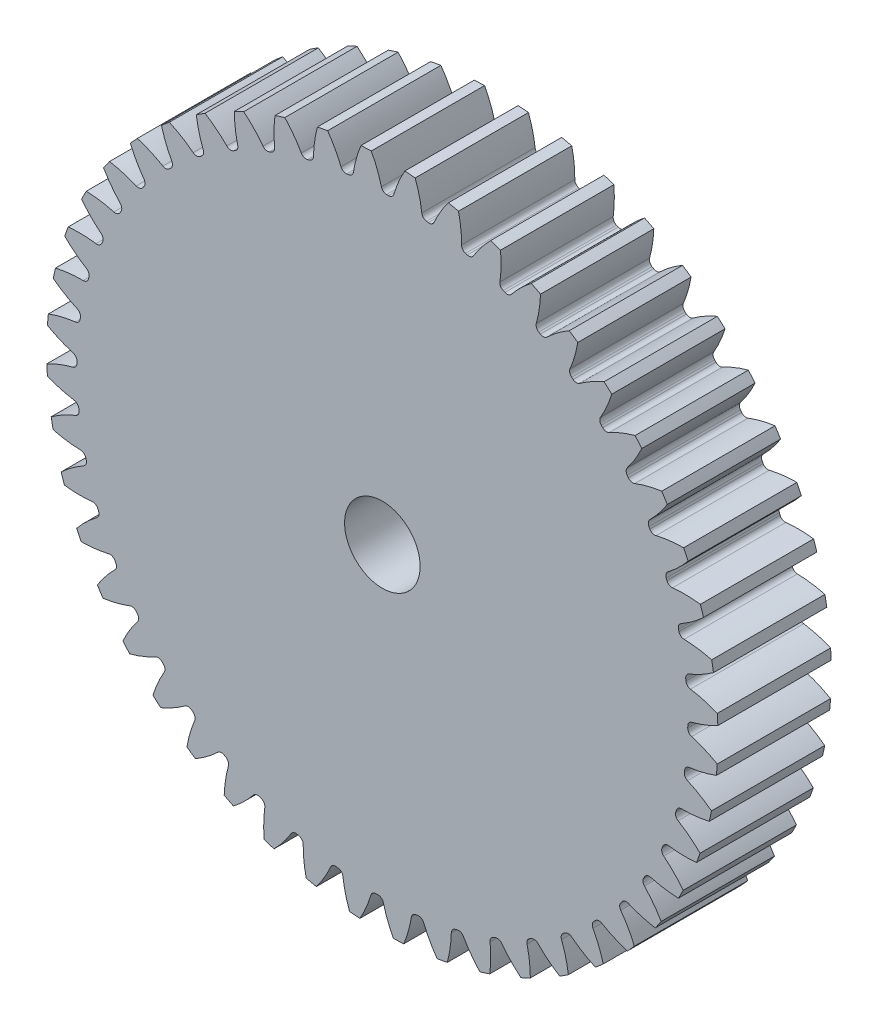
from build123d import *

# Parameters (mm, degrees)
SKETCH3_R         = 282.222222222
GEARBODY_DEPTH    = 95.25
TOOTHCUT_DEPTH    = 411.330754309
CIRPATTERN1_COUNT = 48
BOREDIA_R         = 31.75
BORE_DEPTH        = 12700


with BuildPart() as part:
    # Sketch3 → gearBody (new body)
    with BuildSketch(Plane.XY):
        Circle(SKETCH3_R)
    extrude(amount=GEARBODY_DEPTH)

    # Sketch2 → toothCut (cut, through all)
    with BuildSketch(Plane.XY):
        with BuildLine():
            ThreePointArc((256.770112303, -5.173321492), (256.784958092, -4.374828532), (256.797320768, -3.576293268))
            ThreePointArc((256.797320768, -3.576293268), (257.777729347, -0.802819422), (260.239456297, 0.807540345))
            ThreePointArc((260.239456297, 0.807540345), (271.485126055, 4.443032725), (282.222222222, 9.382330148))
            ThreePointArc((282.222222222, 9.382330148), (282.337162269, -4.810159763), (281.738836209, -18.990497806))
            ThreePointArc((281.738836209, -18.990497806), (271.176223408, -13.688318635), (260.060919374, -9.671863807))
            ThreePointArc((260.060919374, -9.671863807), (257.655476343, -7.978582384), (256.770112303, -5.173321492))
        make_face()
    toothcut = extrude(amount=TOOTHCUT_DEPTH, mode=Mode.SUBTRACT)

    # CirPattern1: toothCut ×48 about axis
    cirpattern1_axis = Axis((0, 0, 0), (0, 0, 1))
    for i in range(1, CIRPATTERN1_COUNT):
        add(toothcut.rotate(cirpattern1_axis, i * 360 / CIRPATTERN1_COUNT), mode=Mode.SUBTRACT)

    # boreDia → bore (cut, symmetric)
    with BuildSketch(Plane.XY):
        Circle(BOREDIA_R)
    extrude(amount=BORE_DEPTH, both=True, mode=Mode.SUBTRACT)


solid = part.part
